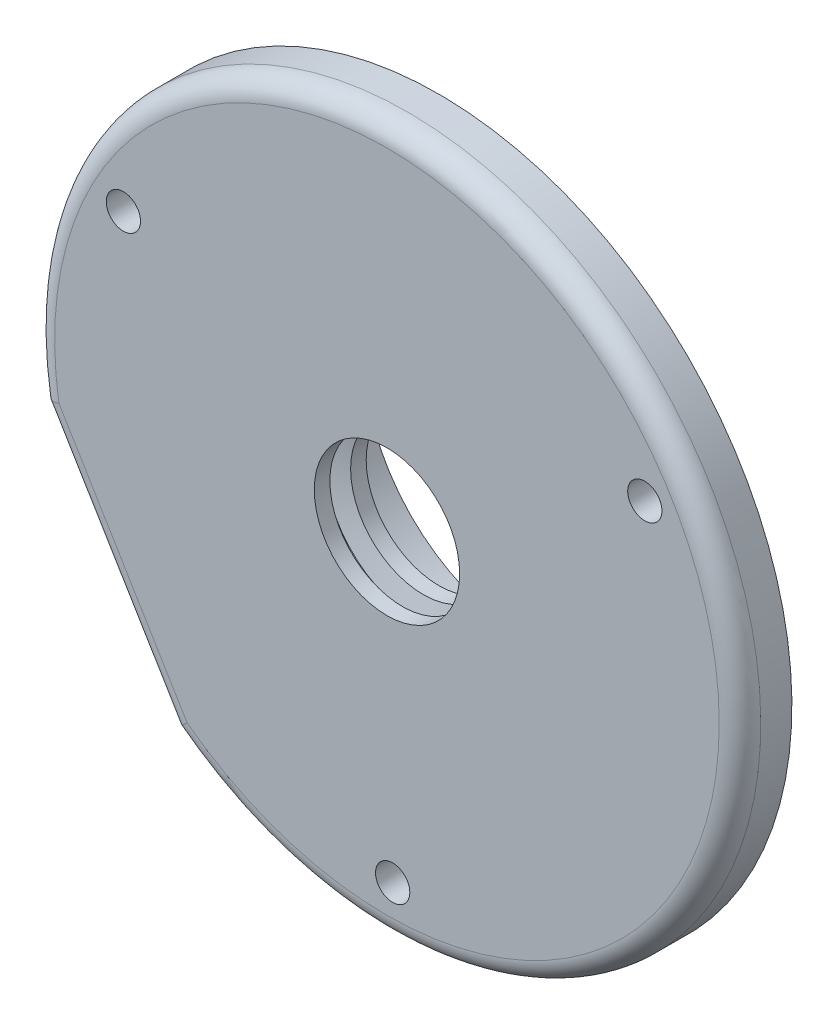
from build123d import *

# Parameters (mm, degrees)
SKETCH_1_R         = 20
SKETCH_1_R_2       = 15.704
EXTRUDE_1_DEPTH    = 8.5
SKETCH_2_R         = 7
EXTRUDE_3_DEPTH    = 5
HOLE_WIZARD_M4_1_D = 3.3
FILLET_1_R         = 2


with BuildPart() as part:
    # Sketch 1 → Extrude 1 (new body)
    with BuildSketch(Plane.XY):
        Circle(SKETCH_1_R)
        Circle(SKETCH_1_R_2, mode=Mode.SUBTRACT)
    extrude(amount=EXTRUDE_1_DEPTH)

    # Sketch 2 → Extrude 3 (add)
    with BuildSketch(Plane.XY.offset(8.5)):
        with BuildLine():
            Line((-33.503472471, -5.789415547), (-20.75850589, -26.927391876))
            ThreePointArc((-20.75850589, -26.927391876), (29.116903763, 17.55579435), (-33.503472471, -5.789415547))
        make_face()
        Circle(SKETCH_2_R, mode=Mode.SUBTRACT)
    extrude(amount=EXTRUDE_3_DEPTH)

    # Hole Wizard M4 _1 (through all)
    with Locations(Plane.XY.offset(13.5)):
        with Locations((-25.385419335, 14.020716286), (24.83500615, 14.974059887), (0.550413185, -28.994776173)):
            Hole(HOLE_WIZARD_M4_1_D / 2)

    # Fillet 1
    fillet_1_edges = [part.edges().sort_by_distance(p)[0] for p in [
        (29.116903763, 17.55579435, 13.5),
        (-27.13098918, -16.358403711, 13.5),
    ]]
    fillet(fillet_1_edges, radius=FILLET_1_R)

    # Sketch 5 → Cut-Revolve 1 (revolve, cut)
    with BuildSketch(Plane(origin=(0, 0, 0), x_dir=(1, 0, 0), z_dir=(0, 1, 0)), mode=Mode.PRIVATE) as cut_revolve_1_sk:
        Polygon((7, -12), (7, -10), (9, -10.5), (9, -11.5), align=None)
    revolve(cut_revolve_1_sk.sketch.rotate(Axis((0, 0, 0), (0, 0, 1)), 180), axis=Axis((0, 0, 0), (0, 0, 1)), mode=Mode.SUBTRACT)


solid = part.part
